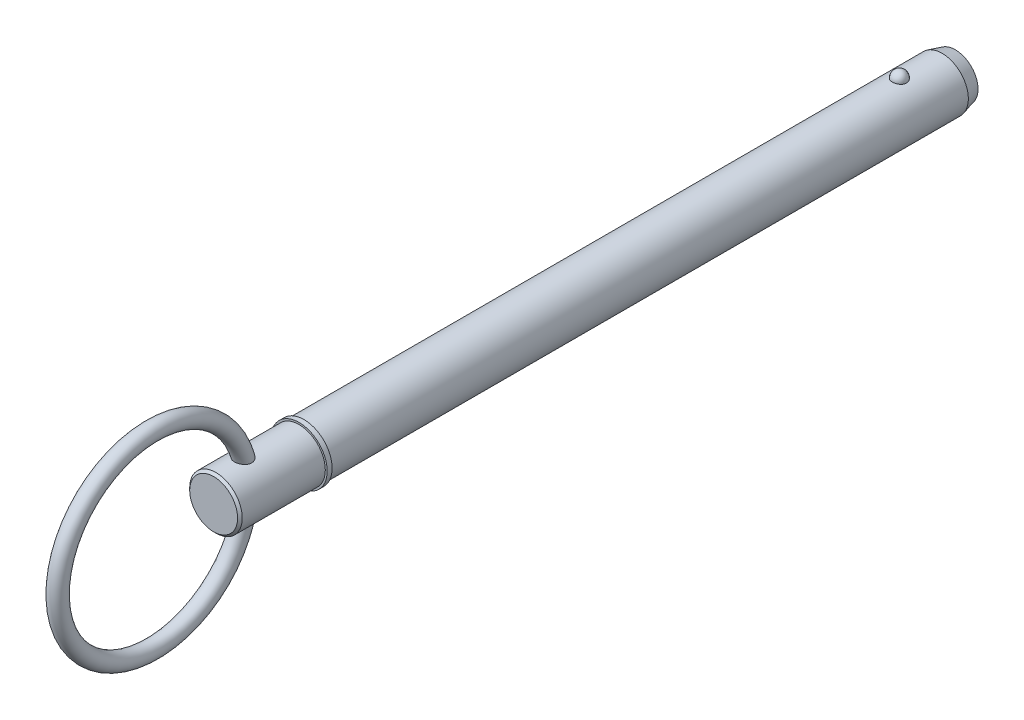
from build123d import *

# Parameters (mm, degrees)
SKETCH2_R           = 7.94
BOSS_EXTRUDE1_DEPTH = 177.8
BOSS_EXTRUDE2_START = 19.05
SKETCH3_R           = 7.94
BOSS_EXTRUDE2_DEPTH = 19.05
CHAMFER1_SIZE       = 4
CHAMFER1_SIZE2      = 1.07179677
SKETCH20_W          = 1.5
SKETCH20_H          = 8.5
SKETCH21_R          = 7.94
BOSS_EXTRUDE3_DEPTH = 27.31
CHAMFER2_SIZE       = 0.7
SKETCH24_R          = 2.5


with BuildPart() as part:
    # Sketch2 → Boss-Extrude1 (new body)
    with BuildSketch(Plane.XY):
        Circle(SKETCH2_R)
    extrude(amount=BOSS_EXTRUDE1_DEPTH)

    # Sketch3 → Boss-Extrude2 (add)
    with BuildSketch(Plane(origin=(0, 0, 0), x_dir=(-1, 0, 0), z_dir=(0, 0, -1)).offset(BOSS_EXTRUDE2_START)):
        Circle(SKETCH3_R)
    extrude(amount=-BOSS_EXTRUDE2_DEPTH)

    # Chamfer1
    chamfer1_edges = [part.edges().sort_by_distance(p)[0] for p in [
        (7.94, 0, -19.05),
    ]]
    chamfer1_side = [part.faces().sort_by_distance(p)[0] for p in [
        (7.94, 0, -9.525),
    ]]
    chamfer(chamfer1_edges, length=CHAMFER1_SIZE, length2=CHAMFER1_SIZE2, reference=chamfer1_side[0])

    # Sketch18 → Revolve1 (revolve)
    with BuildSketch(Plane(origin=(0, 0, 0), x_dir=(0, 0, -1), z_dir=(1, 0, 0))):
        with BuildLine():
            Line((2.15, 10.09), (2.15, 5.79))
            ThreePointArc((2.15, 5.79), (0, 7.94), (2.15, 10.09))
        make_face()
    revolve(axis=Axis((0, 10.09, -2.15), (0, -1, 0)))

    # Sketch20 → Revolve2 (revolve)
    with BuildSketch(Plane(origin=(0, 0, 0), x_dir=(0, 0, -1), z_dir=(1, 0, 0)), mode=Mode.PRIVATE) as revolve2_sk:
        with Locations((-178.55, 4.25)):
            Rectangle(SKETCH20_W, SKETCH20_H)
    revolve(revolve2_sk.sketch.rotate(Axis((0, 0, 33.728787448), (0, 0, 1)), 90), axis=Axis((0, 0, 33.728787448), (0, 0, 1)))

    # Sketch21 → Boss-Extrude3 (add)
    with BuildSketch(Plane(origin=(0, 0, 177.8), x_dir=(-1, 0, 0), z_dir=(0, 0, -1))):
        Circle(SKETCH21_R)
    extrude(amount=-BOSS_EXTRUDE3_DEPTH)

    # Chamfer2
    chamfer2_edges = [part.edges().sort_by_distance(p)[0] for p in [
        (7.94, 0, 205.11),
    ]]
    chamfer(chamfer2_edges, length=CHAMFER2_SIZE)

    # Sweep1: sweep along a path in Sketch23
    with BuildLine(Plane(origin=(0, 0, 0), x_dir=(0, 0, -1), z_dir=(1, 0, 0))) as sweep1_path:
        CenterArc((-223.685, 0), 28.575, 0, 360)
    # Sketch24 → Sweep1 (sweep)
    with BuildSketch(Plane(origin=(0, 0, 0), x_dir=(1, 0, 0), z_dir=(0, 1, 0))):
        with Locations((0, -195.11)):
            Circle(SKETCH24_R)
    sweep(path=sweep1_path.line)


solid = part.part
